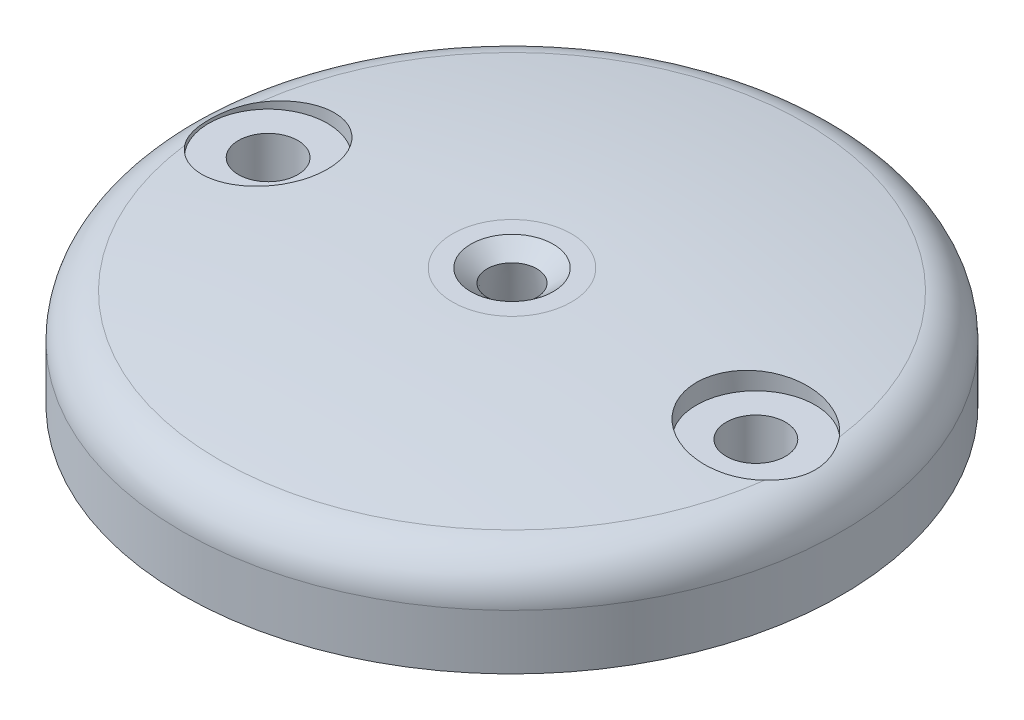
ISO-10303-21;
HEADER;
FILE_DESCRIPTION(('STEP AP214'),'2;1');
FILE_NAME('part.step','',(''),(''),'','','');
FILE_SCHEMA(('AUTOMOTIVE_DESIGN { 1 0 10303 214 1 1 1 1 }'));
ENDSEC;
DATA;
#1=APPLICATION_CONTEXT('core data for automotive mechanical design processes');
#2=APPLICATION_PROTOCOL_DEFINITION('international standard','automotive_design',2000,#1);
#3=PRODUCT_CONTEXT('',#1,'mechanical');
#4=PRODUCT('Part','Part','',(#3));
#5=PRODUCT_RELATED_PRODUCT_CATEGORY('part','',(#4));
#6=PRODUCT_DEFINITION_FORMATION('','',#4);
#7=PRODUCT_DEFINITION_CONTEXT('part definition',#1,'design');
#8=PRODUCT_DEFINITION('design','',#6,#7);
#9=PRODUCT_DEFINITION_SHAPE('','',#8);
#10=(LENGTH_UNIT() NAMED_UNIT(*) SI_UNIT(.MILLI.,.METRE.));
#11=(NAMED_UNIT(*) PLANE_ANGLE_UNIT() SI_UNIT($,.RADIAN.));
#12=(NAMED_UNIT(*) SI_UNIT($,.STERADIAN.) SOLID_ANGLE_UNIT());
#13=UNCERTAINTY_MEASURE_WITH_UNIT(LENGTH_MEASURE(1.E-05),#10,'distance_accuracy_value','');
#14=(GEOMETRIC_REPRESENTATION_CONTEXT(3) GLOBAL_UNCERTAINTY_ASSIGNED_CONTEXT((#13)) GLOBAL_UNIT_ASSIGNED_CONTEXT((#10,
#11,#12)) REPRESENTATION_CONTEXT('',''));
#15=CARTESIAN_POINT('',(0.,0.,0.));
#16=DIRECTION('',(0.,0.,1.));
#17=DIRECTION('',(1.,0.,0.));
#18=AXIS2_PLACEMENT_3D('',#15,#16,#17);
#19=CARTESIAN_POINT('',(0.,17.9999999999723,0.));
#20=DIRECTION('',(0.,1.,0.));
#21=DIRECTION('',(0.,0.,1.));
#22=AXIS2_PLACEMENT_3D('',#19,#20,#21);
#23=CONICAL_SURFACE('',#22,6.25000000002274,0.896055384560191);
#24=CARTESIAN_POINT('',(0.,16.0110151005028,0.));
#25=DIRECTION('',(0.,-1.,0.));
#26=DIRECTION('',(1.,0.,0.));
#27=AXIS2_PLACEMENT_3D('',#24,#25,#26);
#28=CIRCLE('',#27,3.76376887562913);
#29=CARTESIAN_POINT('',(3.76376887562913,16.0110151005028,0.));
#30=VERTEX_POINT('',#29);
#31=EDGE_CURVE('E69',#30,#30,#28,.T.);
#32=ORIENTED_EDGE('',*,*,#31,.T.);
#33=EDGE_LOOP('',(#32));
#34=FACE_BOUND('',#33,.T.);
#35=CARTESIAN_POINT('',(0.,17.9999999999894,0.));
#36=DIRECTION('',(0.,1.,0.));
#37=DIRECTION('',(0.,0.,1.));
#38=AXIS2_PLACEMENT_3D('',#35,#36,#37);
#39=CIRCLE('',#38,6.25000000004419);
#40=CARTESIAN_POINT('',(0.,17.9999999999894,6.25000000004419));
#41=VERTEX_POINT('',#40);
#42=EDGE_CURVE('E251',#41,#41,#39,.F.);
#43=ORIENTED_EDGE('',*,*,#42,.F.);
#44=EDGE_LOOP('',(#43));
#45=FACE_BOUND('',#44,.T.);
#46=ADVANCED_FACE('F15',(#34,#45),#23,.F.);
#47=CARTESIAN_POINT('',(4.49999999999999,18.,0.));
#48=DIRECTION('',(0.,1.,0.));
#49=DIRECTION('',(0.,0.,1.));
#50=AXIS2_PLACEMENT_3D('',#47,#48,#49);
#51=PLANE('',#50);
#52=CARTESIAN_POINT('',(0.,18.0000000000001,0.));
#53=DIRECTION('',(0.,-1.,0.));
#54=DIRECTION('',(0.,0.,1.));
#55=AXIS2_PLACEMENT_3D('',#52,#53,#54);
#56=CIRCLE('',#55,9.00000000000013);
#57=CARTESIAN_POINT('',(0.,18.,8.99999999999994));
#58=VERTEX_POINT('',#57);
#59=CARTESIAN_POINT('',(0.,18.,-8.99999999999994));
#60=VERTEX_POINT('',#59);
#61=EDGE_CURVE('E63',#58,#60,#56,.T.);
#62=ORIENTED_EDGE('',*,*,#61,.F.);
#63=CARTESIAN_POINT('',(0.,18.0000000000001,0.));
#64=DIRECTION('',(0.,-1.,0.));
#65=DIRECTION('',(1.,0.,0.));
#66=AXIS2_PLACEMENT_3D('',#63,#64,#65);
#67=CIRCLE('',#66,9.00000000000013);
#68=CARTESIAN_POINT('',(9.00000000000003,18.,0.));
#69=VERTEX_POINT('',#68);
#70=EDGE_CURVE('E58',#69,#58,#67,.T.);
#71=ORIENTED_EDGE('',*,*,#70,.F.);
#72=CARTESIAN_POINT('',(0.,18.0000000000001,0.));
#73=DIRECTION('',(0.,-1.,0.));
#74=DIRECTION('',(0.,0.,-1.));
#75=AXIS2_PLACEMENT_3D('',#72,#73,#74);
#76=CIRCLE('',#75,9.00000000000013);
#77=EDGE_CURVE('E67',#60,#69,#76,.T.);
#78=ORIENTED_EDGE('',*,*,#77,.F.);
#79=EDGE_LOOP('',(#62,#71,#78));
#80=FACE_BOUND('',#79,.T.);
#81=ORIENTED_EDGE('',*,*,#42,.T.);
#82=EDGE_LOOP('',(#81));
#83=FACE_BOUND('',#82,.T.);
#84=ADVANCED_FACE('F65',(#80,#83),#51,.T.);
#85=CARTESIAN_POINT('',(0.,8.99999999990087,0.));
#86=DIRECTION('',(0.,-1.,0.));
#87=DIRECTION('',(0.,0.,-1.));
#88=AXIS2_PLACEMENT_3D('',#85,#86,#87);
#89=CONICAL_SURFACE('',#88,5.00000000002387,0.174532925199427);
#90=CARTESIAN_POINT('',(0.,8.99999999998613,0.));
#91=DIRECTION('',(0.,1.,0.));
#92=DIRECTION('',(1.,0.,0.));
#93=AXIS2_PLACEMENT_3D('',#90,#91,#92);
#94=CIRCLE('',#93,4.99999999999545);
#95=CARTESIAN_POINT('',(4.99999999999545,8.99999999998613,0.));
#96=VERTEX_POINT('',#95);
#97=EDGE_CURVE('E77',#96,#96,#94,.F.);
#98=ORIENTED_EDGE('',*,*,#97,.T.);
#99=EDGE_LOOP('',(#98));
#100=FACE_BOUND('',#99,.T.);
#101=ORIENTED_EDGE('',*,*,#31,.F.);
#102=EDGE_LOOP('',(#101));
#103=FACE_BOUND('',#102,.T.);
#104=ADVANCED_FACE('F93',(#100,#103),#89,.F.);
#105=CARTESIAN_POINT('',(0.,-239.615972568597,4.50000000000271));
#106=DIRECTION('',(1.,0.,0.));
#107=DIRECTION('',(0.,0.,1.));
#108=AXIS2_PLACEMENT_3D('',#105,#106,#107);
#109=CIRCLE('',#108,257.655272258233);
#110=TRIMMED_CURVE('',#109,(PARAMETER_VALUE(-1.58826241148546)),
(PARAMETER_VALUE(1.58826241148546)),.T.,.PARAMETER.);
#111=CARTESIAN_POINT('',(0.,-239.615972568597,0.));
#112=DIRECTION('',(0.,1.,0.));
#113=AXIS1_PLACEMENT('',#111,#112);
#114=SURFACE_OF_REVOLUTION('',#110,#113);
#115=CARTESIAN_POINT('',(0.,14.9366472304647,0.));
#116=DIRECTION('',(0.,1.,0.));
#117=DIRECTION('',(0.,0.,1.));
#118=AXIS2_PLACEMENT_3D('',#115,#116,#117);
#119=CIRCLE('',#118,44.3648099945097);
#120=CARTESIAN_POINT('',(44.003194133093,14.9366472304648,5.65289942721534));
#121=VERTEX_POINT('',#120);
#122=CARTESIAN_POINT('',(-44.003194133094,14.936647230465,5.65289942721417));
#123=VERTEX_POINT('',#122);
#124=EDGE_CURVE('E107',#121,#123,#119,.F.);
#125=ORIENTED_EDGE('',*,*,#124,.F.);
#126=CARTESIAN_POINT('',(44.0031941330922,14.9366472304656,5.65289942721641));
#127=CARTESIAN_POINT('',(43.8434615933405,14.9575097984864,5.85083060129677));
#128=CARTESIAN_POINT('',(43.6753584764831,14.9794525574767,6.04188054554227));
#129=CARTESIAN_POINT('',(43.3237499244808,15.0253144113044,6.40894998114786));
#130=CARTESIAN_POINT('',(43.1402458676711,15.0492333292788,6.58497081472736));
#131=CARTESIAN_POINT('',(42.759328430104,15.0988433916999,6.92058846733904));
#132=CARTESIAN_POINT('',(42.5619285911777,15.1245328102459,7.08020091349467));
#133=CARTESIAN_POINT('',(42.1545002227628,15.1775074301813,7.38210019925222));
#134=CARTESIAN_POINT('',(41.9444717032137,15.2047926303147,7.52438705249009));
#135=CARTESIAN_POINT('',(41.5132406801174,15.2607598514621,7.7906929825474));
#136=CARTESIAN_POINT('',(41.2920354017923,15.2894422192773,7.91470749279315));
#137=CARTESIAN_POINT('',(40.8400744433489,15.3479833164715,8.1435859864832));
#138=CARTESIAN_POINT('',(40.6093185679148,15.3778420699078,8.24844957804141));
#139=CARTESIAN_POINT('',(40.1399224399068,15.4385107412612,8.43830402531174));
#140=CARTESIAN_POINT('',(39.901283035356,15.4693205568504,8.52329701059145));
#141=CARTESIAN_POINT('',(39.4177796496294,15.5316679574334,8.67285291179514));
#142=CARTESIAN_POINT('',(39.1729156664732,15.5632055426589,8.73741582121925));
#143=CARTESIAN_POINT('',(38.6774342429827,15.6269391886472,8.84595152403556));
#144=CARTESIAN_POINT('',(38.4267940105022,15.6591377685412,8.88981880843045));
#145=CARTESIAN_POINT('',(37.9226474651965,15.7238138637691,8.95619264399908));
#146=CARTESIAN_POINT('',(37.6691401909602,15.7562914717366,8.97869180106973));
#147=CARTESIAN_POINT('',(37.1611431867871,15.8212778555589,9.00214882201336));
#148=CARTESIAN_POINT('',(36.9066534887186,15.8537866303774,9.00310737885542));
#149=CARTESIAN_POINT('',(36.398475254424,15.9186025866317,8.98347522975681));
#150=CARTESIAN_POINT('',(36.1447867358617,15.9509097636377,8.96288405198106));
#151=CARTESIAN_POINT('',(35.6392382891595,16.0151882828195,8.90019114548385));
#152=CARTESIAN_POINT('',(35.3873863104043,16.0471582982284,8.85802392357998));
#153=CARTESIAN_POINT('',(34.8880940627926,16.1104324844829,8.75242619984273));
#154=CARTESIAN_POINT('',(34.6406538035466,16.1417366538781,8.68899565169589));
#155=CARTESIAN_POINT('',(34.1519651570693,16.2034548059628,8.54130274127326));
#156=CARTESIAN_POINT('',(33.9107165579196,16.2338688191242,8.45704109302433));
#157=CARTESIAN_POINT('',(33.43614432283,16.2935914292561,8.26826129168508));
#158=CARTESIAN_POINT('',(33.2028204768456,16.3229000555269,8.16374367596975));
#159=CARTESIAN_POINT('',(32.7462467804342,16.3801478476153,7.93540171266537));
#160=CARTESIAN_POINT('',(32.5229773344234,16.4080896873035,7.8116172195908));
#161=CARTESIAN_POINT('',(32.087703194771,16.4624638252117,7.54548797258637));
#162=CARTESIAN_POINT('',(31.8756945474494,16.4888966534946,7.40314979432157));
#163=CARTESIAN_POINT('',(31.4643888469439,16.5400834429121,7.10085578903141));
#164=CARTESIAN_POINT('',(31.2650928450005,16.5648372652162,6.94089850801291));
#165=CARTESIAN_POINT('',(30.8806995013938,16.6124948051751,6.60449779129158));
#166=CARTESIAN_POINT('',(30.6956020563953,16.6353985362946,6.4280544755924));
#167=CARTESIAN_POINT('',(30.3421549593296,16.6790564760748,6.06115125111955));
#168=CARTESIAN_POINT('',(30.1737023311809,16.6998239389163,5.87079211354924));
#169=CARTESIAN_POINT('',(29.853403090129,16.7392454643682,5.47637568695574));
#170=CARTESIAN_POINT('',(29.7015564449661,16.7578995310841,5.27231842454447));
#171=CARTESIAN_POINT('',(29.4155273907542,16.7929827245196,4.85185099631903));
#172=CARTESIAN_POINT('',(29.2813535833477,16.8094107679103,4.6354348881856));
#173=CARTESIAN_POINT('',(29.0317649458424,16.839926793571,4.1918948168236));
#174=CARTESIAN_POINT('',(28.9163494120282,16.8540148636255,3.96477125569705));
#175=CARTESIAN_POINT('',(28.7058341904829,16.8796796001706,3.50296821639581));
#176=CARTESIAN_POINT('',(28.6106060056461,16.8912721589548,3.26834818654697));
#177=CARTESIAN_POINT('',(28.4402269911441,16.9119923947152,2.7918282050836));
#178=CARTESIAN_POINT('',(28.3650754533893,16.9211201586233,2.54992851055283));
#179=CARTESIAN_POINT('',(28.2355398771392,16.9368415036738,2.06108150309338));
#180=CARTESIAN_POINT('',(28.1811142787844,16.943440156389,1.81414534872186));
#181=CARTESIAN_POINT('',(28.0932453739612,16.9540885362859,1.31661722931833));
#182=CARTESIAN_POINT('',(28.0597909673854,16.9581396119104,1.06602727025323));
#183=CARTESIAN_POINT('',(28.0246294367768,16.9623966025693,0.679131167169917));
#184=CARTESIAN_POINT('',(28.0153959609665,16.9635142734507,0.543478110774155));
#185=CARTESIAN_POINT('',(28.0030808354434,16.9650048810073,0.271888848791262));
#186=CARTESIAN_POINT('',(27.999999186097,16.9653778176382,0.135952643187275));
#187=CARTESIAN_POINT('',(28.0000015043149,16.9653775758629,-0.251277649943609));
#188=CARTESIAN_POINT('',(28.0105330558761,16.9641031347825,-0.502611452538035));
#189=CARTESIAN_POINT('',(28.0525917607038,16.9590113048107,-1.00354547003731));
#190=CARTESIAN_POINT('',(28.0841260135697,16.9551930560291,-1.25314506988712));
#191=CARTESIAN_POINT('',(28.16803267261,16.945025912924,-1.74920881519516));
#192=CARTESIAN_POINT('',(28.2204403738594,16.938672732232,-1.99566691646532));
#193=CARTESIAN_POINT('',(28.3457536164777,16.9234662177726,-2.48344103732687));
#194=CARTESIAN_POINT('',(28.4186752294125,16.9146109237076,-2.72475286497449));
#195=CARTESIAN_POINT('',(28.58429765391,16.8944734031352,-3.19986268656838));
#196=CARTESIAN_POINT('',(28.6769600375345,16.8831958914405,-3.43367427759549));
#197=CARTESIAN_POINT('',(28.8815110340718,16.8582649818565,-3.89272500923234));
#198=CARTESIAN_POINT('',(28.993408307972,16.8446105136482,-4.11796023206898));
#199=CARTESIAN_POINT('',(29.2355881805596,16.8150104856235,-4.55818224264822));
#200=CARTESIAN_POINT('',(29.365872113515,16.7990647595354,-4.77316828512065));
#201=CARTESIAN_POINT('',(29.6438066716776,16.7649886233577,-5.19128202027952));
#202=CARTESIAN_POINT('',(29.7914495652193,16.7468591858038,-5.3944149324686));
#203=CARTESIAN_POINT('',(30.1036543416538,16.7084526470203,-5.7882460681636));
#204=CARTESIAN_POINT('',(30.2682766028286,16.6881678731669,-5.97889567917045));
#205=CARTESIAN_POINT('',(30.6126255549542,16.6456567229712,-6.34544088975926));
#206=CARTESIAN_POINT('',(30.7923374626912,16.6234322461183,-6.52135059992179));
#207=CARTESIAN_POINT('',(31.1658039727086,16.5771578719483,-6.8574999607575));
#208=CARTESIAN_POINT('',(31.3595653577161,16.5531070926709,-7.01773195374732));
#209=CARTESIAN_POINT('',(31.7597184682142,16.5033420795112,-7.32137595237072));
#210=CARTESIAN_POINT('',(31.9661131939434,16.4776274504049,-7.46478393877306));
#211=CARTESIAN_POINT('',(32.391478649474,16.4245301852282,-7.73468867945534));
#212=CARTESIAN_POINT('',(32.610525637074,16.3971373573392,-7.86106325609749));
#213=CARTESIAN_POINT('',(33.0583422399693,16.3410302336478,-8.09488352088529));
#214=CARTESIAN_POINT('',(33.2871120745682,16.3123159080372,-8.20232878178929));
#215=CARTESIAN_POINT('',(33.7527527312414,16.2537632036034,-8.3975663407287));
#216=CARTESIAN_POINT('',(33.9896236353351,16.2239248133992,-8.48535843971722));
#217=CARTESIAN_POINT('',(34.4698000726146,16.1633302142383,-8.64070399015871));
#218=CARTESIAN_POINT('',(34.7131057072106,16.1325739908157,-8.70825712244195));
#219=CARTESIAN_POINT('',(35.2061789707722,16.0701385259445,-8.82307955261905));
#220=CARTESIAN_POINT('',(35.4559800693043,16.0384543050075,-8.87020245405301));
#221=CARTESIAN_POINT('',(35.9586922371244,15.974586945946,-8.9431655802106));
#222=CARTESIAN_POINT('',(36.2116042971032,15.9424036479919,-8.96899883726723));
#223=CARTESIAN_POINT('',(36.7186250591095,15.8777843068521,-8.99918389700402));
#224=CARTESIAN_POINT('',(36.9727335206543,15.8453483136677,-9.0035398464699));
#225=CARTESIAN_POINT('',(37.480405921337,15.7804503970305,-8.99075548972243));
#226=CARTESIAN_POINT('',(37.7339698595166,15.7479884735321,-8.97361514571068));
#227=CARTESIAN_POINT('',(38.2398174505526,15.6831387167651,-8.91783993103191));
#228=CARTESIAN_POINT('',(38.492091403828,15.6507517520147,-8.87911603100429));
#229=CARTESIAN_POINT('',(38.9924143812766,15.5864363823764,-8.78039187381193));
#230=CARTESIAN_POINT('',(39.2404647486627,15.5545078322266,-8.72039851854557));
#231=CARTESIAN_POINT('',(39.7307874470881,15.4913176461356,-8.57950470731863));
#232=CARTESIAN_POINT('',(39.9730566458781,15.4600563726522,-8.49859318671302));
#233=CARTESIAN_POINT('',(40.4499374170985,15.3984523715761,-8.31643423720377));
#234=CARTESIAN_POINT('',(40.684549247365,15.3681096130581,-8.21518749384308));
#235=CARTESIAN_POINT('',(41.1443506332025,15.3085806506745,-7.99309207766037));
#236=CARTESIAN_POINT('',(41.3695435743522,15.2793940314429,-7.87225052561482));
#237=CARTESIAN_POINT('',(41.808962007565,15.2223877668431,-7.61177463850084));
#238=CARTESIAN_POINT('',(42.0231878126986,15.1945680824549,-7.47214084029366));
#239=CARTESIAN_POINT('',(42.4388208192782,15.1405463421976,-7.17526082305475));
#240=CARTESIAN_POINT('',(42.640245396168,15.114342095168,-7.01803931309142));
#241=CARTESIAN_POINT('',(43.0290453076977,15.0637216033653,-6.68698365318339));
#242=CARTESIAN_POINT('',(43.2164278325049,15.039304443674,-6.51315811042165));
#243=CARTESIAN_POINT('',(43.5029764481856,15.0019391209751,-6.22369569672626));
#244=CARTESIAN_POINT('',(43.6071205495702,14.9883528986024,-6.11302263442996));
#245=CARTESIAN_POINT('',(43.8095548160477,14.9619336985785,-5.88667828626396));
#246=CARTESIAN_POINT('',(43.9078539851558,14.9490995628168,-5.77101518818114));
#247=CARTESIAN_POINT('',(44.0031941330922,14.9366472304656,-5.65289942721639));
#248=B_SPLINE_CURVE_WITH_KNOTS('',3,(#126,#127,#128,#129,#130,#131,#132,#133,#134,#135,#136,
#137,#138,#139,#140,#141,#142,#143,#144,#145,#146,#147,#148,#149,#150,#151,#152,#153,#154,#155,
#156,#157,#158,#159,#160,#161,#162,#163,#164,#165,#166,#167,#168,#169,#170,#171,#172,#173,#174,
#175,#176,#177,#178,#179,#180,#181,#182,#183,#184,#185,#186,#187,#188,#189,#190,#191,#192,#193,
#194,#195,#196,#197,#198,#199,#200,#201,#202,#203,#204,#205,#206,#207,#208,#209,#210,#211,#212,
#213,#214,#215,#216,#217,#218,#219,#220,#221,#222,#223,#224,#225,#226,#227,#228,#229,#230,#231,
#232,#233,#234,#235,#236,#237,#238,#239,#240,#241,#242,#243,#244,#245,#246,#247),.UNSPECIFIED.,
.F.,.F.,(4,2,2,2,2,2,2,2,2,2,2,2,2,2,2,2,2,2,2,2,2,2,2,2,2,2,2,2,2,2,2,2,2,2,2,2,2,2,2,2,2,2,2,
2,2,2,2,2,2,2,2,2,2,2,2,2,2,2,2,2,4),(0.,0.765353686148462,1.53063894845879,2.29518847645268,
3.05973740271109,3.82447708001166,4.58923240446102,5.3539057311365,6.11857930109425,
6.88711023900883,7.65590701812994,8.42467906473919,9.19346794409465,9.96460441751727,
10.7357425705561,11.506854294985,12.2779455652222,13.0474624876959,13.8167074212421,
14.5860158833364,15.3553187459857,16.1195171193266,16.88371400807,17.6482814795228,
18.4128202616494,19.1723358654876,19.9318246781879,20.6897824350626,21.4473386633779,
21.8551283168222,22.2629179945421,23.0166247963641,23.7705865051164,24.525828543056,
25.2816639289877,26.0360412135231,26.7907590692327,27.5455317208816,28.2999694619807,
29.0571890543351,29.8136752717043,30.5705291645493,31.3275635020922,32.0897677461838,
32.8519891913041,33.6142183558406,34.3764595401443,35.1440758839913,35.9119433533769,
36.6796625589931,37.447383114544,38.2182941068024,38.9889551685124,39.7600247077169,
40.5310682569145,41.3018322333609,42.0725741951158,42.8422466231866,43.6115222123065,
44.0690691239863,44.5258918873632),.UNSPECIFIED.);
#249=CARTESIAN_POINT('',(44.0031941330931,14.9366472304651,-5.65289942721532));
#250=VERTEX_POINT('',#249);
#251=EDGE_CURVE('E36',#121,#250,#248,.T.);
#252=ORIENTED_EDGE('',*,*,#251,.T.);
#253=CARTESIAN_POINT('',(0.,14.9366472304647,0.));
#254=DIRECTION('',(0.,1.,0.));
#255=DIRECTION('',(0.,0.,1.));
#256=AXIS2_PLACEMENT_3D('',#253,#254,#255);
#257=CIRCLE('',#256,44.3648099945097);
#258=CARTESIAN_POINT('',(-44.0031941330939,14.9366472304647,-5.6528994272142));
#259=VERTEX_POINT('',#258);
#260=EDGE_CURVE('E44',#259,#250,#257,.F.);
#261=ORIENTED_EDGE('',*,*,#260,.F.);
#262=CARTESIAN_POINT('',(-44.0031941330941,14.9366472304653,-5.65289942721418));
#263=CARTESIAN_POINT('',(-43.8434615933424,14.9575097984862,-5.8508306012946));
#264=CARTESIAN_POINT('',(-43.6753584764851,14.9794525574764,-6.04188054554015));
#265=CARTESIAN_POINT('',(-43.3237499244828,15.0253144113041,-6.40894998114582));
#266=CARTESIAN_POINT('',(-43.1402458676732,15.0492333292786,-6.58497081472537));
#267=CARTESIAN_POINT('',(-42.7593284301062,15.0988433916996,-6.92058846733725));
#268=CARTESIAN_POINT('',(-42.56192859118,15.1245328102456,-7.08020091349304));
#269=CARTESIAN_POINT('',(-42.154500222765,15.177507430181,-7.38210019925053));
#270=CARTESIAN_POINT('',(-41.9444717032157,15.2047926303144,-7.52438705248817));
#271=CARTESIAN_POINT('',(-41.5132406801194,15.2607598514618,-7.79069298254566));
#272=CARTESIAN_POINT('',(-41.2920354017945,15.289442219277,-7.91470749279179));
#273=CARTESIAN_POINT('',(-40.8400744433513,15.3479833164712,-8.14358598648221));
#274=CARTESIAN_POINT('',(-40.6093185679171,15.3778420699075,-8.2484495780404));
#275=CARTESIAN_POINT('',(-40.1399224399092,15.4385107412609,-8.43830402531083));
#276=CARTESIAN_POINT('',(-39.9012830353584,15.46932055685,-8.52329701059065));
#277=CARTESIAN_POINT('',(-39.4177796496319,15.5316679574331,-8.67285291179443));
#278=CARTESIAN_POINT('',(-39.1729156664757,15.5632055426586,-8.73741582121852));
#279=CARTESIAN_POINT('',(-38.6774342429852,15.6269391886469,-8.84595152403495));
#280=CARTESIAN_POINT('',(-38.4267940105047,15.6591377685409,-8.88981880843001));
#281=CARTESIAN_POINT('',(-37.9226474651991,15.7238138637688,-8.95619264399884));
#282=CARTESIAN_POINT('',(-37.6691401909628,15.7562914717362,-8.97869180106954));
#283=CARTESIAN_POINT('',(-37.1611431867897,15.8212778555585,-9.0021488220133));
#284=CARTESIAN_POINT('',(-36.9066534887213,15.8537866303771,-9.00310737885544));
#285=CARTESIAN_POINT('',(-36.3984752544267,15.9186025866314,-8.983475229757));
#286=CARTESIAN_POINT('',(-36.1447867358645,15.9509097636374,-8.96288405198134));
#287=CARTESIAN_POINT('',(-35.6392382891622,16.0151882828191,-8.90019114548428));
#288=CARTESIAN_POINT('',(-35.3873863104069,16.0471582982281,-8.85802392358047));
#289=CARTESIAN_POINT('',(-34.8880940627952,16.1104324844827,-8.75242619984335));
#290=CARTESIAN_POINT('',(-34.6406538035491,16.1417366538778,-8.68899565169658));
#291=CARTESIAN_POINT('',(-34.1519651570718,16.2034548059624,-8.5413027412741));
#292=CARTESIAN_POINT('',(-33.9107165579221,16.2338688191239,-8.45704109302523));
#293=CARTESIAN_POINT('',(-33.4361443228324,16.2935914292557,-8.26826129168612));
#294=CARTESIAN_POINT('',(-33.2028204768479,16.3229000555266,-8.16374367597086));
#295=CARTESIAN_POINT('',(-32.7462467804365,16.380147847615,-7.9354017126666));
#296=CARTESIAN_POINT('',(-32.5229773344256,16.4080896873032,-7.81161721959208));
#297=CARTESIAN_POINT('',(-32.0877031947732,16.4624638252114,-7.54548797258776));
#298=CARTESIAN_POINT('',(-31.8756945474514,16.4888966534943,-7.40314979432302));
#299=CARTESIAN_POINT('',(-31.4643888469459,16.5400834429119,-7.10085578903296));
#300=CARTESIAN_POINT('',(-31.2650928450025,16.564837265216,-6.94089850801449));
#301=CARTESIAN_POINT('',(-30.8806995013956,16.6124948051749,-6.60449779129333));
#302=CARTESIAN_POINT('',(-30.695602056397,16.6353985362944,-6.4280544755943));
#303=CARTESIAN_POINT('',(-30.3421549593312,16.6790564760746,-6.06115125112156));
#304=CARTESIAN_POINT('',(-30.1737023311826,16.6998239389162,-5.87079211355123));
#305=CARTESIAN_POINT('',(-29.8534030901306,16.739245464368,-5.47637568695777));
#306=CARTESIAN_POINT('',(-29.7015564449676,16.7578995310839,-5.27231842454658));
#307=CARTESIAN_POINT('',(-29.4155273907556,16.7929827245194,-4.85185099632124));
#308=CARTESIAN_POINT('',(-29.2813535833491,16.8094107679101,-4.63543488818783));
#309=CARTESIAN_POINT('',(-29.0317649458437,16.8399267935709,-4.19189481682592));
#310=CARTESIAN_POINT('',(-28.9163494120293,16.8540148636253,-3.96477125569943));
#311=CARTESIAN_POINT('',(-28.7058341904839,16.8796796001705,-3.50296821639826));
#312=CARTESIAN_POINT('',(-28.610606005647,16.8912721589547,-3.26834818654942));
#313=CARTESIAN_POINT('',(-28.440226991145,16.9119923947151,-2.79182820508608));
#314=CARTESIAN_POINT('',(-28.36507545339,16.9211201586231,-2.54992851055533));
#315=CARTESIAN_POINT('',(-28.2355398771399,16.9368415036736,-2.06108150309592));
#316=CARTESIAN_POINT('',(-28.181114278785,16.9434401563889,-1.8141453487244));
#317=CARTESIAN_POINT('',(-28.0932453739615,16.9540885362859,-1.31661722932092));
#318=CARTESIAN_POINT('',(-28.0597909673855,16.9581396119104,-1.06602727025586));
#319=CARTESIAN_POINT('',(-28.0246294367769,16.9623966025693,-0.67913116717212));
#320=CARTESIAN_POINT('',(-28.0153959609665,16.9635142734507,-0.543478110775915));
#321=CARTESIAN_POINT('',(-28.0030808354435,16.9650048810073,-0.271888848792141));
#322=CARTESIAN_POINT('',(-27.999999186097,16.9653778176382,-0.135952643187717));
#323=CARTESIAN_POINT('',(-28.0000015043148,16.9653775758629,0.251277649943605));
#324=CARTESIAN_POINT('',(-28.0105330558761,16.9641031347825,0.502611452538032));
#325=CARTESIAN_POINT('',(-28.0525917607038,16.9590113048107,1.00354547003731));
#326=CARTESIAN_POINT('',(-28.0841260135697,16.9551930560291,1.25314506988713));
#327=CARTESIAN_POINT('',(-28.16803267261,16.945025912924,1.74920881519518));
#328=CARTESIAN_POINT('',(-28.2204403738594,16.938672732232,1.99566691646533));
#329=CARTESIAN_POINT('',(-28.3457536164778,16.9234662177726,2.48344103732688));
#330=CARTESIAN_POINT('',(-28.4186752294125,16.9146109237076,2.72475286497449));
#331=CARTESIAN_POINT('',(-28.58429765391,16.8944734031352,3.19986268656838));
#332=CARTESIAN_POINT('',(-28.6769600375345,16.8831958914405,3.43367427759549));
#333=CARTESIAN_POINT('',(-28.8815110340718,16.8582649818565,3.89272500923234));
#334=CARTESIAN_POINT('',(-28.993408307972,16.8446105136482,4.11796023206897));
#335=CARTESIAN_POINT('',(-29.2355881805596,16.8150104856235,4.55818224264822));
#336=CARTESIAN_POINT('',(-29.365872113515,16.7990647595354,4.77316828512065));
#337=CARTESIAN_POINT('',(-29.6438066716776,16.7649886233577,5.19128202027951));
#338=CARTESIAN_POINT('',(-29.7914495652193,16.7468591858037,5.39441493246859));
#339=CARTESIAN_POINT('',(-30.1036543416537,16.7084526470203,5.78824606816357));
#340=CARTESIAN_POINT('',(-30.2682766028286,16.6881678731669,5.97889567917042));
#341=CARTESIAN_POINT('',(-30.6126255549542,16.6456567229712,6.34544088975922));
#342=CARTESIAN_POINT('',(-30.7923374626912,16.6234322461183,6.52135059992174));
#343=CARTESIAN_POINT('',(-31.1658039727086,16.5771578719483,6.85749996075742));
#344=CARTESIAN_POINT('',(-31.3595653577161,16.5531070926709,7.01773195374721));
#345=CARTESIAN_POINT('',(-31.7597184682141,16.5033420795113,7.32137595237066));
#346=CARTESIAN_POINT('',(-31.9661131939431,16.4776274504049,7.46478393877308));
#347=CARTESIAN_POINT('',(-32.3914786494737,16.4245301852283,7.73468867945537));
#348=CARTESIAN_POINT('',(-32.6105256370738,16.3971373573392,7.86106325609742));
#349=CARTESIAN_POINT('',(-33.0583422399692,16.3410302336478,8.09488352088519));
#350=CARTESIAN_POINT('',(-33.2871120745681,16.3123159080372,8.20232878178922));
#351=CARTESIAN_POINT('',(-33.7527527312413,16.2537632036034,8.39756634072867));
#352=CARTESIAN_POINT('',(-33.989623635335,16.2239248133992,8.4853584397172));
#353=CARTESIAN_POINT('',(-34.4698000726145,16.1633302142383,8.64070399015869));
#354=CARTESIAN_POINT('',(-34.7131057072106,16.1325739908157,8.70825712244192));
#355=CARTESIAN_POINT('',(-35.2061789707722,16.0701385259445,8.82307955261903));
#356=CARTESIAN_POINT('',(-35.4559800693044,16.0384543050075,8.87020245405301));
#357=CARTESIAN_POINT('',(-35.9586922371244,15.974586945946,8.94316558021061));
#358=CARTESIAN_POINT('',(-36.2116042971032,15.9424036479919,8.96899883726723));
#359=CARTESIAN_POINT('',(-36.7186250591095,15.8777843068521,8.99918389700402));
#360=CARTESIAN_POINT('',(-36.9727335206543,15.8453483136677,9.00353984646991));
#361=CARTESIAN_POINT('',(-37.480405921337,15.7804503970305,8.99075548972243));
#362=CARTESIAN_POINT('',(-37.7339698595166,15.7479884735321,8.97361514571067));
#363=CARTESIAN_POINT('',(-38.2398174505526,15.6831387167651,8.9178399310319));
#364=CARTESIAN_POINT('',(-38.492091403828,15.6507517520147,8.87911603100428));
#365=CARTESIAN_POINT('',(-38.9924143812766,15.5864363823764,8.78039187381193));
#366=CARTESIAN_POINT('',(-39.2404647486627,15.5545078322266,8.72039851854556));
#367=CARTESIAN_POINT('',(-39.7307874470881,15.4913176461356,8.57950470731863));
#368=CARTESIAN_POINT('',(-39.9730566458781,15.4600563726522,8.49859318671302));
#369=CARTESIAN_POINT('',(-40.4499374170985,15.3984523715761,8.31643423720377));
#370=CARTESIAN_POINT('',(-40.684549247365,15.3681096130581,8.21518749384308));
#371=CARTESIAN_POINT('',(-41.1443506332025,15.3085806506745,7.99309207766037));
#372=CARTESIAN_POINT('',(-41.3695435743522,15.2793940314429,7.87225052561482));
#373=CARTESIAN_POINT('',(-41.808962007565,15.2223877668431,7.61177463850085));
#374=CARTESIAN_POINT('',(-42.0231878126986,15.1945680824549,7.47214084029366));
#375=CARTESIAN_POINT('',(-42.4388208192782,15.1405463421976,7.17526082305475));
#376=CARTESIAN_POINT('',(-42.640245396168,15.114342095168,7.01803931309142));
#377=CARTESIAN_POINT('',(-43.0290453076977,15.0637216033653,6.6869836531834));
#378=CARTESIAN_POINT('',(-43.2164278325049,15.039304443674,6.51315811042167));
#379=CARTESIAN_POINT('',(-43.5029764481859,15.001939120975,6.22369569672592));
#380=CARTESIAN_POINT('',(-43.6071205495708,14.9883528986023,6.11302263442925));
#381=CARTESIAN_POINT('',(-43.809554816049,14.9619336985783,5.88667828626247));
#382=CARTESIAN_POINT('',(-43.9078539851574,14.9490995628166,5.77101518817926));
#383=CARTESIAN_POINT('',(-44.0031941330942,14.9366472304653,5.65289942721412));
#384=B_SPLINE_CURVE_WITH_KNOTS('',3,(#262,#263,#264,#265,#266,#267,#268,#269,#270,#271,#272,
#273,#274,#275,#276,#277,#278,#279,#280,#281,#282,#283,#284,#285,#286,#287,#288,#289,#290,#291,
#292,#293,#294,#295,#296,#297,#298,#299,#300,#301,#302,#303,#304,#305,#306,#307,#308,#309,#310,
#311,#312,#313,#314,#315,#316,#317,#318,#319,#320,#321,#322,#323,#324,#325,#326,#327,#328,#329,
#330,#331,#332,#333,#334,#335,#336,#337,#338,#339,#340,#341,#342,#343,#344,#345,#346,#347,#348,
#349,#350,#351,#352,#353,#354,#355,#356,#357,#358,#359,#360,#361,#362,#363,#364,#365,#366,#367,
#368,#369,#370,#371,#372,#373,#374,#375,#376,#377,#378,#379,#380,#381,#382,#383),.UNSPECIFIED.,
.F.,.F.,(4,2,2,2,2,2,2,2,2,2,2,2,2,2,2,2,2,2,2,2,2,2,2,2,2,2,2,2,2,2,2,2,2,2,2,2,2,2,2,2,2,2,2,
2,2,2,2,2,2,2,2,2,2,2,2,2,2,2,2,2,4),(0.,0.765353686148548,1.53063894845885,2.29518847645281,
3.05973740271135,3.82447708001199,4.58923240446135,5.35390573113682,6.11857930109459,
6.88711023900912,7.65590701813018,8.42467906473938,9.19346794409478,9.96460441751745,
10.7357425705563,11.5068542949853,12.2779455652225,13.0474624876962,13.8167074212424,
14.5860158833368,15.3553187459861,16.1195171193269,16.8837140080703,17.6482814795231,
18.4128202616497,19.1723358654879,19.9318246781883,20.689782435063,21.4473386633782,
21.8551283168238,22.262917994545,23.016624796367,23.7705865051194,24.5258285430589,
25.2816639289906,26.0360412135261,26.7907590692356,27.5455317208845,28.2999694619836,
29.057189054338,29.8136752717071,30.5705291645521,31.327563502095,32.0897677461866,
32.8519891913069,33.6142183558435,34.3764595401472,35.1440758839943,35.9119433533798,
36.679662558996,37.4473831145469,38.2182941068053,38.9889551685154,39.7600247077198,
40.5310682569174,41.3018322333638,42.0725741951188,42.8422466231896,43.6115222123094,
44.0690691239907,44.5258918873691),.UNSPECIFIED.);
#385=EDGE_CURVE('E127',#259,#123,#384,.T.);
#386=ORIENTED_EDGE('',*,*,#385,.T.);
#387=EDGE_LOOP('',(#125,#252,#261,#386));
#388=FACE_BOUND('',#387,.T.);
#389=ORIENTED_EDGE('',*,*,#77,.T.);
#390=ORIENTED_EDGE('',*,*,#70,.T.);
#391=ORIENTED_EDGE('',*,*,#61,.T.);
#392=EDGE_LOOP('',(#389,#390,#391));
#393=FACE_BOUND('',#392,.T.);
#394=ADVANCED_FACE('F73',(#388,#393),#114,.F.);
#395=CARTESIAN_POINT('',(0.,8.35025972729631,0.));
#396=DIRECTION('',(0.,1.,0.));
#397=DIRECTION('',(0.,0.,1.));
#398=AXIS2_PLACEMENT_3D('',#395,#396,#397);
#399=TOROIDAL_SURFACE('',#398,43.3333333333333,6.66666666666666);
#400=CARTESIAN_POINT('',(0.,8.35025972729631,0.));
#401=DIRECTION('',(0.,1.,0.));
#402=DIRECTION('',(0.,0.,1.));
#403=AXIS2_PLACEMENT_3D('',#400,#401,#402);
#404=CIRCLE('',#403,50.);
#405=CARTESIAN_POINT('',(0.,8.35025972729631,50.));
#406=VERTEX_POINT('',#405);
#407=EDGE_CURVE('E118',#406,#406,#404,.F.);
#408=ORIENTED_EDGE('',*,*,#407,.F.);
#409=EDGE_LOOP('',(#408));
#410=FACE_BOUND('',#409,.T.);
#411=CARTESIAN_POINT('',(44.0031941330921,14.9366472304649,-5.65289942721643));
#412=CARTESIAN_POINT('',(44.1219070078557,14.9211329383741,-5.50583721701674));
#413=CARTESIAN_POINT('',(44.2358875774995,14.9040199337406,-5.35514511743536));
#414=CARTESIAN_POINT('',(44.454051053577,14.8676321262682,-5.04705191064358));
#415=CARTESIAN_POINT('',(44.5582329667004,14.8483571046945,-4.88965012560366));
#416=CARTESIAN_POINT('',(44.7564532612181,14.8086821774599,-4.56869992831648));
#417=CARTESIAN_POINT('',(44.850490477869,14.7882821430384,-4.4051508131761));
#418=CARTESIAN_POINT('',(45.0281173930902,14.7473213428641,-4.07245569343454));
#419=CARTESIAN_POINT('',(45.1117052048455,14.7267605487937,-3.9033086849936));
#420=CARTESIAN_POINT('',(45.2681104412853,14.686395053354,-3.56004440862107));
#421=CARTESIAN_POINT('',(45.3409293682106,14.6665902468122,-3.38592783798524));
#422=CARTESIAN_POINT('',(45.4755166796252,14.6285783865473,-3.03335111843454));
#423=CARTESIAN_POINT('',(45.537287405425,14.6103709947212,-2.85489189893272));
#424=CARTESIAN_POINT('',(45.660540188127,14.5729715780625,-2.45887244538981));
#425=CARTESIAN_POINT('',(45.7195938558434,14.554285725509,-2.24050262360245));
#426=CARTESIAN_POINT('',(45.8211434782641,14.5213945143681,-1.79961294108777));
#427=CARTESIAN_POINT('',(45.8636392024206,14.5071892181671,-1.57709302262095));
#428=CARTESIAN_POINT('',(45.9317001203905,14.484127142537,-1.12954669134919));
#429=CARTESIAN_POINT('',(45.9572914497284,14.4752621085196,-0.90452469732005));
#430=CARTESIAN_POINT('',(45.9914438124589,14.4633767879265,-0.453010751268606));
#431=CARTESIAN_POINT('',(46.0000019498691,14.4603574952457,-0.226518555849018));
#432=CARTESIAN_POINT('',(45.9999975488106,14.4603646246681,0.284757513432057));
#433=CARTESIAN_POINT('',(45.9864674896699,14.4651450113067,0.569556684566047));
#434=CARTESIAN_POINT('',(45.9325147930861,14.4838208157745,1.13633720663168));
#435=CARTESIAN_POINT('',(45.8920852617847,14.4977185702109,1.41831781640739));
#436=CARTESIAN_POINT('',(45.7847108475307,14.5333516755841,1.97739711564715));
#437=CARTESIAN_POINT('',(45.7176992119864,14.55510674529,2.25448166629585));
#438=CARTESIAN_POINT('',(45.5579064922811,14.6044081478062,2.8005601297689));
#439=CARTESIAN_POINT('',(45.4651299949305,14.6319534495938,3.06955547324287));
#440=CARTESIAN_POINT('',(45.3043262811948,14.6764943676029,3.47285908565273));
#441=CARTESIAN_POINT('',(45.2452268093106,14.6923474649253,3.61092503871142));
#442=CARTESIAN_POINT('',(45.1202263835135,14.724509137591,3.88386927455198));
#443=CARTESIAN_POINT('',(45.0543267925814,14.7408176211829,4.01874818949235));
#444=CARTESIAN_POINT('',(44.9158753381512,14.7734355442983,4.28502468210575));
#445=CARTESIAN_POINT('',(44.8433241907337,14.7897449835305,4.41642263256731));
#446=CARTESIAN_POINT('',(44.6920409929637,14.8218169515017,4.67491549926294));
#447=CARTESIAN_POINT('',(44.6133368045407,14.8375815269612,4.80202646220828));
#448=CARTESIAN_POINT('',(44.4496280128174,14.8681428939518,5.05226655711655));
#449=CARTESIAN_POINT('',(44.3646227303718,14.8829395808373,5.17539525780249));
#450=CARTESIAN_POINT('',(44.1884681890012,14.9110434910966,5.41741101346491));
#451=CARTESIAN_POINT('',(44.0973170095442,14.9243502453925,5.53629672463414));
#452=CARTESIAN_POINT('',(44.0031941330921,14.9366472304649,5.65289942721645));
#453=B_SPLINE_CURVE_WITH_KNOTS('',3,(#411,#412,#413,#414,#415,#416,#417,#418,#419,#420,#421,
#422,#423,#424,#425,#426,#427,#428,#429,#430,#431,#432,#433,#434,#435,#436,#437,#438,#439,#440,
#441,#442,#443,#444,#445,#446,#447,#448,#449,#450,#451,#452),.UNSPECIFIED.,.F.,.F.,(4,2,2,2,2,2,
2,2,2,2,2,2,2,2,2,2,2,2,2,2,4),(0.,0.568776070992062,1.13760973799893,1.70650864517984,
2.27551012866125,2.84443216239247,3.41323348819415,4.09349261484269,4.77376121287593,
5.45297558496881,6.13230542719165,6.98629408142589,7.84050168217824,8.69686807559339,
9.55308211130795,10.0059779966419,10.4587832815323,10.9115398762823,11.3623534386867,
11.8132156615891,12.2642194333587),.UNSPECIFIED.);
#454=EDGE_CURVE('E120',#250,#121,#453,.T.);
#455=ORIENTED_EDGE('',*,*,#454,.T.);
#456=ORIENTED_EDGE('',*,*,#124,.T.);
#457=CARTESIAN_POINT('',(-44.003194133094,14.9366472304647,5.65289942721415));
#458=CARTESIAN_POINT('',(-44.1219070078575,14.9211329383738,5.50583721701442));
#459=CARTESIAN_POINT('',(-44.2358875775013,14.9040199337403,5.35514511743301));
#460=CARTESIAN_POINT('',(-44.4540510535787,14.8676321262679,5.04705191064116));
#461=CARTESIAN_POINT('',(-44.558232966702,14.8483571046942,4.8896501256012));
#462=CARTESIAN_POINT('',(-44.7564532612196,14.8086821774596,4.56869992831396));
#463=CARTESIAN_POINT('',(-44.8504904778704,14.788282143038,4.40515081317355));
#464=CARTESIAN_POINT('',(-45.0281173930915,14.7473213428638,4.07245569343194));
#465=CARTESIAN_POINT('',(-45.1117052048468,14.7267605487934,3.90330868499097));
#466=CARTESIAN_POINT('',(-45.2681104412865,14.6863950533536,3.5600444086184));
#467=CARTESIAN_POINT('',(-45.3409293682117,14.6665902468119,3.38592783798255));
#468=CARTESIAN_POINT('',(-45.4755166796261,14.628578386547,3.03335111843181));
#469=CARTESIAN_POINT('',(-45.5372874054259,14.6103709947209,2.85489189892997));
#470=CARTESIAN_POINT('',(-45.6605401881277,14.5729715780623,2.45887244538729));
#471=CARTESIAN_POINT('',(-45.719593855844,14.5542857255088,2.24050262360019));
#472=CARTESIAN_POINT('',(-45.8211434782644,14.521394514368,1.79961294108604));
#473=CARTESIAN_POINT('',(-45.8636392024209,14.507189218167,1.57709302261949));
#474=CARTESIAN_POINT('',(-45.9317001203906,14.4841271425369,1.12954669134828));
#475=CARTESIAN_POINT('',(-45.9572914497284,14.4752621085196,0.904524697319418));
#476=CARTESIAN_POINT('',(-45.9914438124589,14.4633767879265,0.453010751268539));
#477=CARTESIAN_POINT('',(-46.0000019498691,14.4603574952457,0.226518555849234));
#478=CARTESIAN_POINT('',(-45.9999975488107,14.460364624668,-0.284757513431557));
#479=CARTESIAN_POINT('',(-45.9864674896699,14.4651450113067,-0.569556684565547));
#480=CARTESIAN_POINT('',(-45.9325147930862,14.4838208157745,-1.13633720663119));
#481=CARTESIAN_POINT('',(-45.8920852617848,14.4977185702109,-1.41831781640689));
#482=CARTESIAN_POINT('',(-45.7847108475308,14.533351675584,-1.97739711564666));
#483=CARTESIAN_POINT('',(-45.7176992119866,14.5551067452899,-2.25448166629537));
#484=CARTESIAN_POINT('',(-45.5579064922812,14.6044081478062,-2.80056012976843));
#485=CARTESIAN_POINT('',(-45.4651299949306,14.6319534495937,-3.06955547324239));
#486=CARTESIAN_POINT('',(-45.304326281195,14.6764943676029,-3.47285908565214));
#487=CARTESIAN_POINT('',(-45.2452268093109,14.6923474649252,-3.61092503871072));
#488=CARTESIAN_POINT('',(-45.1202263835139,14.7245091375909,-3.88386927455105));
#489=CARTESIAN_POINT('',(-45.054326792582,14.7408176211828,-4.01874818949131));
#490=CARTESIAN_POINT('',(-44.9158753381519,14.7734355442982,-4.28502468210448));
#491=CARTESIAN_POINT('',(-44.8433241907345,14.7897449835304,-4.41642263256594));
#492=CARTESIAN_POINT('',(-44.6920409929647,14.8218169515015,-4.67491549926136));
#493=CARTESIAN_POINT('',(-44.6133368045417,14.837581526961,-4.8020264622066));
#494=CARTESIAN_POINT('',(-44.4496280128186,14.8681428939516,-5.05226655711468));
#495=CARTESIAN_POINT('',(-44.3646227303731,14.8829395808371,-5.17539525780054));
#496=CARTESIAN_POINT('',(-44.1884681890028,14.9110434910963,-5.41741101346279));
#497=CARTESIAN_POINT('',(-44.0973170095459,14.9243502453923,-5.53629672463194));
#498=CARTESIAN_POINT('',(-44.003194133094,14.9366472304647,-5.65289942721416));
#499=B_SPLINE_CURVE_WITH_KNOTS('',3,(#457,#458,#459,#460,#461,#462,#463,#464,#465,#466,#467,
#468,#469,#470,#471,#472,#473,#474,#475,#476,#477,#478,#479,#480,#481,#482,#483,#484,#485,#486,
#487,#488,#489,#490,#491,#492,#493,#494,#495,#496,#497,#498),.UNSPECIFIED.,.F.,.F.,(4,2,2,2,2,2,
2,2,2,2,2,2,2,2,2,2,2,2,2,2,4),(0.,0.568776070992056,1.13760973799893,1.70650864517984,
2.27551012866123,2.84443216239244,3.41323348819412,4.0934926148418,4.77376121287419,
5.45297558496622,6.13230542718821,6.98629408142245,7.84050168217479,8.69686807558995,
9.5530821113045,10.0059779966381,10.4587832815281,10.9115398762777,11.3623534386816,
11.8132156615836,12.2642194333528),.UNSPECIFIED.);
#500=EDGE_CURVE('E50',#123,#259,#499,.T.);
#501=ORIENTED_EDGE('',*,*,#500,.T.);
#502=ORIENTED_EDGE('',*,*,#260,.T.);
#503=EDGE_LOOP('',(#455,#456,#501,#502));
#504=FACE_BOUND('',#503,.T.);
#505=ADVANCED_FACE('F92',(#410,#504),#399,.T.);
#506=CARTESIAN_POINT('',(0.,8.99999999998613,0.));
#507=DIRECTION('',(0.,1.,0.));
#508=DIRECTION('',(0.,0.,1.));
#509=AXIS2_PLACEMENT_3D('',#506,#507,#508);
#510=CONICAL_SURFACE('',#509,4.99999999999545,1.30899693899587);
#511=CARTESIAN_POINT('',(0.,9.66987298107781,0.));
#512=DIRECTION('',(0.,1.,0.));
#513=DIRECTION('',(0.,0.,1.));
#514=AXIS2_PLACEMENT_3D('',#511,#512,#513);
#515=CIRCLE('',#514,7.5);
#516=CARTESIAN_POINT('',(0.,9.66987298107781,7.5));
#517=VERTEX_POINT('',#516);
#518=EDGE_CURVE('E115',#517,#517,#515,.F.);
#519=ORIENTED_EDGE('',*,*,#518,.T.);
#520=EDGE_LOOP('',(#519));
#521=FACE_BOUND('',#520,.T.);
#522=ORIENTED_EDGE('',*,*,#97,.F.);
#523=EDGE_LOOP('',(#522));
#524=FACE_BOUND('',#523,.T.);
#525=ADVANCED_FACE('F229',(#521,#524),#510,.T.);
#526=CARTESIAN_POINT('',(-37.,17.,0.));
#527=DIRECTION('',(0.,-1.,0.));
#528=DIRECTION('',(0.,0.,-1.));
#529=AXIS2_PLACEMENT_3D('',#526,#527,#528);
#530=CYLINDRICAL_SURFACE('',#529,9.);
#531=CARTESIAN_POINT('',(-37.,14.,0.));
#532=DIRECTION('',(0.,-1.,0.));
#533=DIRECTION('',(0.,0.,-1.));
#534=AXIS2_PLACEMENT_3D('',#531,#532,#533);
#535=CIRCLE('',#534,9.);
#536=CARTESIAN_POINT('',(-37.,14.,-9.));
#537=VERTEX_POINT('',#536);
#538=EDGE_CURVE('E117',#537,#537,#535,.T.);
#539=ORIENTED_EDGE('',*,*,#538,.T.);
#540=EDGE_LOOP('',(#539));
#541=FACE_BOUND('',#540,.T.);
#542=ORIENTED_EDGE('',*,*,#500,.F.);
#543=ORIENTED_EDGE('',*,*,#385,.F.);
#544=EDGE_LOOP('',(#542,#543));
#545=FACE_BOUND('',#544,.T.);
#546=ADVANCED_FACE('F145',(#541,#545),#530,.F.);
#547=CARTESIAN_POINT('',(37.,16.99,0.));
#548=DIRECTION('',(0.,1.,0.));
#549=DIRECTION('',(0.,0.,1.));
#550=AXIS2_PLACEMENT_3D('',#547,#548,#549);
#551=CYLINDRICAL_SURFACE('',#550,9.);
#552=ORIENTED_EDGE('',*,*,#251,.F.);
#553=ORIENTED_EDGE('',*,*,#454,.F.);
#554=EDGE_LOOP('',(#552,#553));
#555=FACE_BOUND('',#554,.T.);
#556=CARTESIAN_POINT('',(37.,13.99,0.));
#557=DIRECTION('',(0.,1.,0.));
#558=DIRECTION('',(0.,0.,1.));
#559=AXIS2_PLACEMENT_3D('',#556,#557,#558);
#560=CIRCLE('',#559,9.);
#561=CARTESIAN_POINT('',(37.,13.99,9.));
#562=VERTEX_POINT('',#561);
#563=EDGE_CURVE('E216',#562,#562,#560,.F.);
#564=ORIENTED_EDGE('',*,*,#563,.T.);
#565=EDGE_LOOP('',(#564));
#566=FACE_BOUND('',#565,.T.);
#567=ADVANCED_FACE('F139',(#555,#566),#551,.F.);
#568=CARTESIAN_POINT('',(0.,4.17512986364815,0.));
#569=DIRECTION('',(0.,1.,0.));
#570=DIRECTION('',(0.,0.,1.));
#571=AXIS2_PLACEMENT_3D('',#568,#569,#570);
#572=CYLINDRICAL_SURFACE('',#571,50.);
#573=ORIENTED_EDGE('',*,*,#407,.T.);
#574=EDGE_LOOP('',(#573));
#575=FACE_BOUND('',#574,.T.);
#576=CARTESIAN_POINT('',(0.,0.,0.));
#577=DIRECTION('',(0.,1.,0.));
#578=DIRECTION('',(0.,0.,1.));
#579=AXIS2_PLACEMENT_3D('',#576,#577,#578);
#580=CIRCLE('',#579,50.);
#581=CARTESIAN_POINT('',(0.,0.,50.));
#582=VERTEX_POINT('',#581);
#583=EDGE_CURVE('E214',#582,#582,#580,.F.);
#584=ORIENTED_EDGE('',*,*,#583,.F.);
#585=EDGE_LOOP('',(#584));
#586=FACE_BOUND('',#585,.T.);
#587=ADVANCED_FACE('F144',(#575,#586),#572,.T.);
#588=CARTESIAN_POINT('',(0.,5.3349364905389,0.));
#589=DIRECTION('',(0.,1.,0.));
#590=DIRECTION('',(0.,0.,1.));
#591=AXIS2_PLACEMENT_3D('',#588,#589,#590);
#592=CYLINDRICAL_SURFACE('',#591,7.5);
#593=CARTESIAN_POINT('',(0.,1.,0.));
#594=DIRECTION('',(0.,1.,0.));
#595=DIRECTION('',(0.,0.,1.));
#596=AXIS2_PLACEMENT_3D('',#593,#594,#595);
#597=CIRCLE('',#596,7.5);
#598=CARTESIAN_POINT('',(0.,1.,7.5));
#599=VERTEX_POINT('',#598);
#600=EDGE_CURVE('E211',#599,#599,#597,.T.);
#601=ORIENTED_EDGE('',*,*,#600,.F.);
#602=EDGE_LOOP('',(#601));
#603=FACE_BOUND('',#602,.T.);
#604=ORIENTED_EDGE('',*,*,#518,.F.);
#605=EDGE_LOOP('',(#604));
#606=FACE_BOUND('',#605,.T.);
#607=ADVANCED_FACE('F151',(#603,#606),#592,.F.);
#608=CARTESIAN_POINT('',(-43.75,14.,0.));
#609=DIRECTION('',(0.,-1.,0.));
#610=DIRECTION('',(0.,0.,-1.));
#611=AXIS2_PLACEMENT_3D('',#608,#609,#610);
#612=PLANE('',#611);
#613=ORIENTED_EDGE('',*,*,#538,.F.);
#614=EDGE_LOOP('',(#613));
#615=FACE_BOUND('',#614,.T.);
#616=CARTESIAN_POINT('',(-37.,14.,0.));
#617=DIRECTION('',(0.,-1.,0.));
#618=DIRECTION('',(0.,0.,-1.));
#619=AXIS2_PLACEMENT_3D('',#616,#617,#618);
#620=CIRCLE('',#619,4.5);
#621=CARTESIAN_POINT('',(-37.,14.,-4.5));
#622=VERTEX_POINT('',#621);
#623=EDGE_CURVE('E208',#622,#622,#620,.T.);
#624=ORIENTED_EDGE('',*,*,#623,.T.);
#625=EDGE_LOOP('',(#624));
#626=FACE_BOUND('',#625,.T.);
#627=ADVANCED_FACE('F154',(#615,#626),#612,.F.);
#628=CARTESIAN_POINT('',(43.75,13.99,0.));
#629=DIRECTION('',(0.,-1.,0.));
#630=DIRECTION('',(0.,0.,-1.));
#631=AXIS2_PLACEMENT_3D('',#628,#629,#630);
#632=PLANE('',#631);
#633=CARTESIAN_POINT('',(37.,13.99,0.));
#634=DIRECTION('',(0.,1.,0.));
#635=DIRECTION('',(0.,0.,1.));
#636=AXIS2_PLACEMENT_3D('',#633,#634,#635);
#637=CIRCLE('',#636,4.5);
#638=CARTESIAN_POINT('',(37.,13.99,4.5));
#639=VERTEX_POINT('',#638);
#640=EDGE_CURVE('E202',#639,#639,#637,.F.);
#641=ORIENTED_EDGE('',*,*,#640,.T.);
#642=EDGE_LOOP('',(#641));
#643=FACE_BOUND('',#642,.T.);
#644=ORIENTED_EDGE('',*,*,#563,.F.);
#645=EDGE_LOOP('',(#644));
#646=FACE_BOUND('',#645,.T.);
#647=ADVANCED_FACE('F158',(#643,#646),#632,.F.);
#648=CARTESIAN_POINT('',(47.,0.,0.));
#649=DIRECTION('',(0.,-1.,0.));
#650=DIRECTION('',(0.,0.,-1.));
#651=AXIS2_PLACEMENT_3D('',#648,#649,#650);
#652=PLANE('',#651);
#653=CARTESIAN_POINT('',(0.,0.,0.));
#654=DIRECTION('',(0.,1.,0.));
#655=DIRECTION('',(0.,0.,1.));
#656=AXIS2_PLACEMENT_3D('',#653,#654,#655);
#657=CIRCLE('',#656,44.);
#658=CARTESIAN_POINT('',(0.,0.,44.));
#659=VERTEX_POINT('',#658);
#660=EDGE_CURVE('E196',#659,#659,#657,.F.);
#661=ORIENTED_EDGE('',*,*,#660,.F.);
#662=EDGE_LOOP('',(#661));
#663=FACE_BOUND('',#662,.T.);
#664=ORIENTED_EDGE('',*,*,#583,.T.);
#665=EDGE_LOOP('',(#664));
#666=FACE_BOUND('',#665,.T.);
#667=ADVANCED_FACE('F162',(#663,#666),#652,.T.);
#668=CARTESIAN_POINT('',(4.5,1.,0.));
#669=DIRECTION('',(0.,-1.,0.));
#670=DIRECTION('',(0.,0.,-1.));
#671=AXIS2_PLACEMENT_3D('',#668,#669,#670);
#672=PLANE('',#671);
#673=CARTESIAN_POINT('',(0.,1.,0.));
#674=DIRECTION('',(0.,1.,0.));
#675=DIRECTION('',(0.,0.,1.));
#676=AXIS2_PLACEMENT_3D('',#673,#674,#675);
#677=CIRCLE('',#676,9.);
#678=CARTESIAN_POINT('',(0.,1.,9.));
#679=VERTEX_POINT('',#678);
#680=EDGE_CURVE('E194',#679,#679,#677,.T.);
#681=ORIENTED_EDGE('',*,*,#680,.F.);
#682=EDGE_LOOP('',(#681));
#683=FACE_BOUND('',#682,.T.);
#684=ORIENTED_EDGE('',*,*,#600,.T.);
#685=EDGE_LOOP('',(#684));
#686=FACE_BOUND('',#685,.T.);
#687=ADVANCED_FACE('F166',(#683,#686),#672,.T.);
#688=CARTESIAN_POINT('',(-37.,7.,0.));
#689=DIRECTION('',(0.,-1.,0.));
#690=DIRECTION('',(0.,0.,-1.));
#691=AXIS2_PLACEMENT_3D('',#688,#689,#690);
#692=CYLINDRICAL_SURFACE('',#691,4.5);
#693=ORIENTED_EDGE('',*,*,#623,.F.);
#694=EDGE_LOOP('',(#693));
#695=FACE_BOUND('',#694,.T.);
#696=CARTESIAN_POINT('',(-37.,5.5,0.));
#697=DIRECTION('',(0.,-1.,0.));
#698=DIRECTION('',(0.,0.,-1.));
#699=AXIS2_PLACEMENT_3D('',#696,#697,#698);
#700=CIRCLE('',#699,4.5);
#701=CARTESIAN_POINT('',(-37.,5.5,-4.5));
#702=VERTEX_POINT('',#701);
#703=EDGE_CURVE('E195',#702,#702,#700,.F.);
#704=ORIENTED_EDGE('',*,*,#703,.F.);
#705=EDGE_LOOP('',(#704));
#706=FACE_BOUND('',#705,.T.);
#707=ADVANCED_FACE('F170',(#695,#706),#692,.F.);
#708=CARTESIAN_POINT('',(37.,6.99,0.));
#709=DIRECTION('',(0.,1.,0.));
#710=DIRECTION('',(0.,0.,1.));
#711=AXIS2_PLACEMENT_3D('',#708,#709,#710);
#712=CYLINDRICAL_SURFACE('',#711,4.5);
#713=ORIENTED_EDGE('',*,*,#640,.F.);
#714=EDGE_LOOP('',(#713));
#715=FACE_BOUND('',#714,.T.);
#716=CARTESIAN_POINT('',(37.,5.5,0.));
#717=DIRECTION('',(0.,1.,0.));
#718=DIRECTION('',(0.,0.,1.));
#719=AXIS2_PLACEMENT_3D('',#716,#717,#718);
#720=CIRCLE('',#719,4.5);
#721=CARTESIAN_POINT('',(37.,5.5,4.5));
#722=VERTEX_POINT('',#721);
#723=EDGE_CURVE('E199',#722,#722,#720,.T.);
#724=ORIENTED_EDGE('',*,*,#723,.F.);
#725=EDGE_LOOP('',(#724));
#726=FACE_BOUND('',#725,.T.);
#727=ADVANCED_FACE('F174',(#715,#726),#712,.F.);
#728=CARTESIAN_POINT('',(0.,0.,0.));
#729=DIRECTION('',(0.,1.,0.));
#730=DIRECTION('',(0.,0.,1.));
#731=AXIS2_PLACEMENT_3D('',#728,#729,#730);
#732=CYLINDRICAL_SURFACE('',#731,44.);
#733=ORIENTED_EDGE('',*,*,#660,.T.);
#734=EDGE_LOOP('',(#733));
#735=FACE_BOUND('',#734,.T.);
#736=CARTESIAN_POINT('',(0.,5.5,0.));
#737=DIRECTION('',(0.,1.,0.));
#738=DIRECTION('',(0.,0.,1.));
#739=AXIS2_PLACEMENT_3D('',#736,#737,#738);
#740=CIRCLE('',#739,44.);
#741=CARTESIAN_POINT('',(0.,5.5,44.));
#742=VERTEX_POINT('',#741);
#743=EDGE_CURVE('E27',#742,#742,#740,.F.);
#744=ORIENTED_EDGE('',*,*,#743,.F.);
#745=EDGE_LOOP('',(#744));
#746=FACE_BOUND('',#745,.T.);
#747=ADVANCED_FACE('F178',(#735,#746),#732,.F.);
#748=CARTESIAN_POINT('',(0.,3.25,0.));
#749=DIRECTION('',(0.,1.,0.));
#750=DIRECTION('',(0.,0.,1.));
#751=AXIS2_PLACEMENT_3D('',#748,#749,#750);
#752=CYLINDRICAL_SURFACE('',#751,9.);
#753=CARTESIAN_POINT('',(0.,5.5,0.));
#754=DIRECTION('',(0.,1.,0.));
#755=DIRECTION('',(0.,0.,1.));
#756=AXIS2_PLACEMENT_3D('',#753,#754,#755);
#757=CIRCLE('',#756,9.);
#758=CARTESIAN_POINT('',(0.,5.5,9.));
#759=VERTEX_POINT('',#758);
#760=EDGE_CURVE('E9',#759,#759,#757,.T.);
#761=ORIENTED_EDGE('',*,*,#760,.F.);
#762=EDGE_LOOP('',(#761));
#763=FACE_BOUND('',#762,.T.);
#764=ORIENTED_EDGE('',*,*,#680,.T.);
#765=EDGE_LOOP('',(#764));
#766=FACE_BOUND('',#765,.T.);
#767=ADVANCED_FACE('F181',(#763,#766),#752,.T.);
#768=CARTESIAN_POINT('',(26.5,5.5,0.));
#769=DIRECTION('',(0.,-1.,0.));
#770=DIRECTION('',(0.,0.,-1.));
#771=AXIS2_PLACEMENT_3D('',#768,#769,#770);
#772=PLANE('',#771);
#773=ORIENTED_EDGE('',*,*,#760,.T.);
#774=EDGE_LOOP('',(#773));
#775=FACE_BOUND('',#774,.T.);
#776=ORIENTED_EDGE('',*,*,#743,.T.);
#777=EDGE_LOOP('',(#776));
#778=FACE_BOUND('',#777,.T.);
#779=ORIENTED_EDGE('',*,*,#723,.T.);
#780=EDGE_LOOP('',(#779));
#781=FACE_BOUND('',#780,.T.);
#782=ORIENTED_EDGE('',*,*,#703,.T.);
#783=EDGE_LOOP('',(#782));
#784=FACE_BOUND('',#783,.T.);
#785=ADVANCED_FACE('F17',(#775,#778,#781,#784),#772,.T.);
#786=CLOSED_SHELL('',(#46,#84,#104,#394,#505,#525,#546,#567,#587,#607,#627,#647,#667,#687,#707,
#727,#747,#767,#785));
#787=MANIFOLD_SOLID_BREP('B1',#786);
#788=ADVANCED_BREP_SHAPE_REPRESENTATION('',(#18,#787),#14);
#789=SHAPE_DEFINITION_REPRESENTATION(#9,#788);
ENDSEC;
END-ISO-10303-21;
